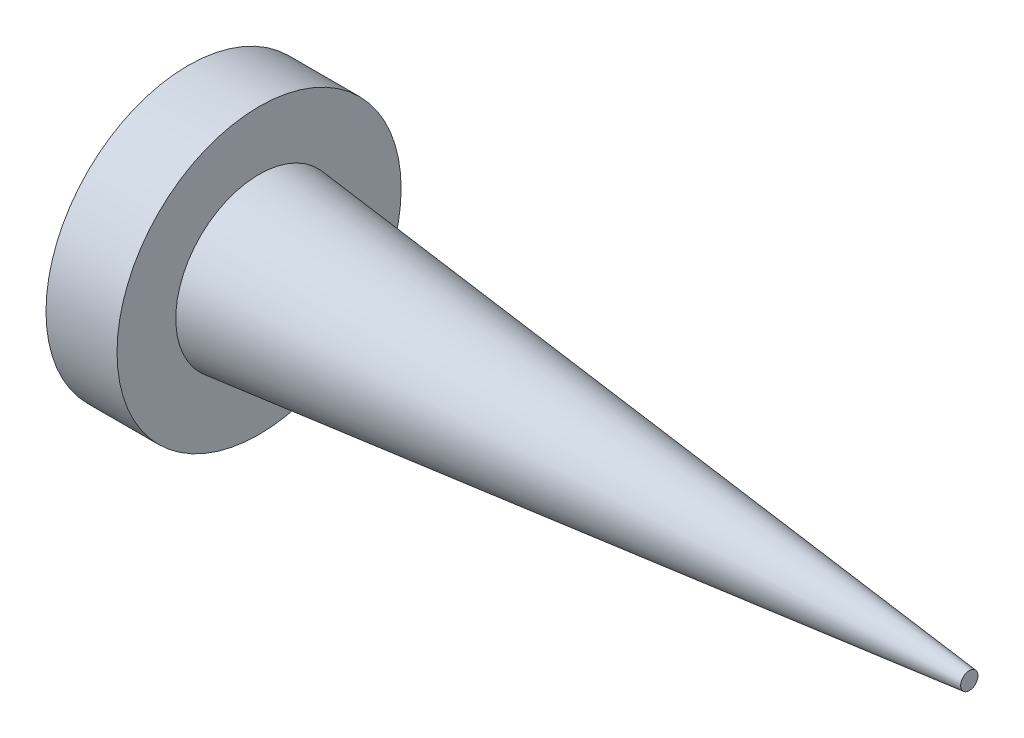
from build123d import *

# Parameters (mm, degrees)
ESQUISSE1_R        = 2
BOSS_EXTRU_1_DEPTH = 1
ESQUISSE2_R        = 1.173210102
BOSS_EXTRU_3_DEPTH = 10
BOSS_EXTRU_3_TAPER = 6


with BuildPart() as part:
    # Esquisse1 → Boss.-Extru.1 (new body)
    with BuildSketch(Plane(origin=(0, 0, 0), x_dir=(0, 0, -1), z_dir=(1, 0, 0))):
        Circle(ESQUISSE1_R)
    extrude(amount=BOSS_EXTRU_1_DEPTH)

    # Esquisse2 → Boss.-Extru.3 (add)
    with BuildSketch(Plane(origin=(1, 0, 0), x_dir=(0, 0, -1), z_dir=(1, 0, 0))):
        Circle(ESQUISSE2_R)
    extrude(amount=BOSS_EXTRU_3_DEPTH, taper=BOSS_EXTRU_3_TAPER)


solid = part.part
